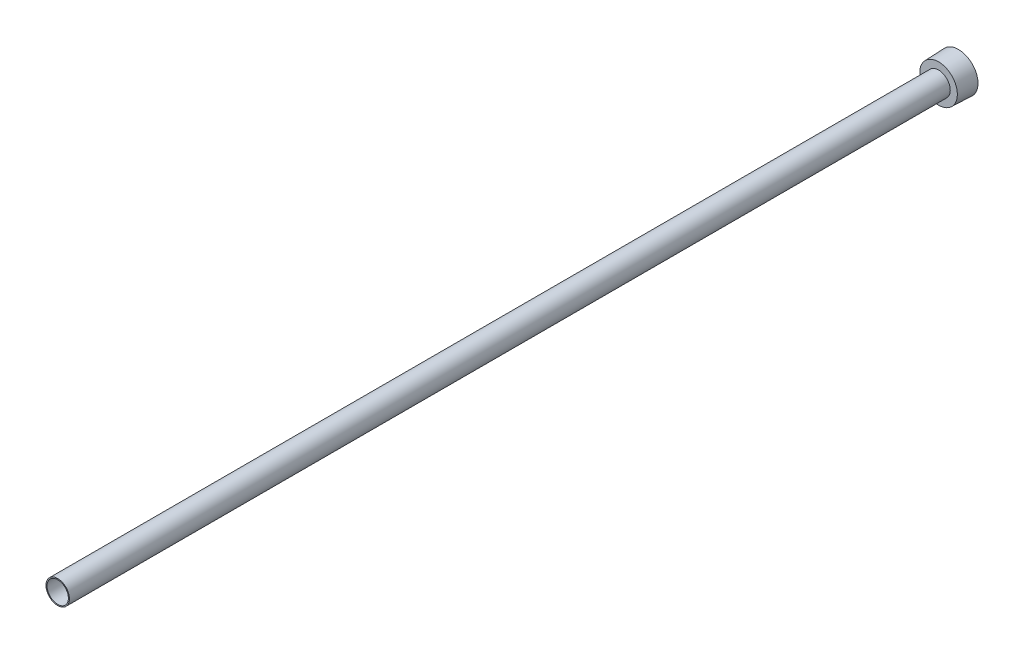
ISO-10303-21;
HEADER;
FILE_DESCRIPTION(('STEP AP214'),'2;1');
FILE_NAME('part.step','',(''),(''),'','','');
FILE_SCHEMA(('AUTOMOTIVE_DESIGN { 1 0 10303 214 1 1 1 1 }'));
ENDSEC;
DATA;
#1=APPLICATION_CONTEXT('core data for automotive mechanical design processes');
#2=APPLICATION_PROTOCOL_DEFINITION('international standard','automotive_design',2000,#1);
#3=PRODUCT_CONTEXT('',#1,'mechanical');
#4=PRODUCT('Part','Part','',(#3));
#5=PRODUCT_RELATED_PRODUCT_CATEGORY('part','',(#4));
#6=PRODUCT_DEFINITION_FORMATION('','',#4);
#7=PRODUCT_DEFINITION_CONTEXT('part definition',#1,'design');
#8=PRODUCT_DEFINITION('design','',#6,#7);
#9=PRODUCT_DEFINITION_SHAPE('','',#8);
#10=(LENGTH_UNIT() NAMED_UNIT(*) SI_UNIT(.MILLI.,.METRE.));
#11=(NAMED_UNIT(*) PLANE_ANGLE_UNIT() SI_UNIT($,.RADIAN.));
#12=(NAMED_UNIT(*) SI_UNIT($,.STERADIAN.) SOLID_ANGLE_UNIT());
#13=UNCERTAINTY_MEASURE_WITH_UNIT(LENGTH_MEASURE(1.E-05),#10,'distance_accuracy_value','');
#14=(GEOMETRIC_REPRESENTATION_CONTEXT(3) GLOBAL_UNCERTAINTY_ASSIGNED_CONTEXT((#13)) GLOBAL_UNIT_ASSIGNED_CONTEXT((#10,
#11,#12)) REPRESENTATION_CONTEXT('',''));
#15=CARTESIAN_POINT('',(0.,0.,0.));
#16=DIRECTION('',(0.,0.,1.));
#17=DIRECTION('',(1.,0.,0.));
#18=AXIS2_PLACEMENT_3D('',#15,#16,#17);
#19=CARTESIAN_POINT('',(0.,0.,0.));
#20=DIRECTION('',(0.,0.,1.));
#21=DIRECTION('',(1.,0.,0.));
#22=AXIS2_PLACEMENT_3D('',#19,#20,#21);
#23=CYLINDRICAL_SURFACE('',#22,7.2263);
#24=CARTESIAN_POINT('',(0.,0.,609.6));
#25=DIRECTION('',(0.,0.,1.));
#26=DIRECTION('',(1.,0.,0.));
#27=AXIS2_PLACEMENT_3D('',#24,#25,#26);
#28=CIRCLE('',#27,7.2263);
#29=CARTESIAN_POINT('',(7.2263,0.,609.6));
#30=VERTEX_POINT('',#29);
#31=EDGE_CURVE('E142',#30,#30,#28,.T.);
#32=CARTESIAN_POINT('',(0.,0.,9.525));
#33=DIRECTION('',(0.,0.,-1.));
#34=DIRECTION('',(-1.,0.,0.));
#35=AXIS2_PLACEMENT_3D('',#32,#33,#34);
#36=CIRCLE('',#35,7.2263);
#37=CARTESIAN_POINT('',(7.2263,0.,9.525));
#38=VERTEX_POINT('',#37);
#39=EDGE_CURVE('E37',#38,#38,#36,.F.);
#40=CARTESIAN_POINT('',(7.2263,0.,609.6));
#41=CARTESIAN_POINT('',(7.2263,0.,603.34921875));
#42=CARTESIAN_POINT('',(7.2263,0.,597.0984375));
#43=CARTESIAN_POINT('',(7.2263,0.,584.596875));
#44=CARTESIAN_POINT('',(7.2263,0.,578.34609375));
#45=CARTESIAN_POINT('',(7.2263,0.,565.84453125));
#46=CARTESIAN_POINT('',(7.2263,0.,559.59375));
#47=CARTESIAN_POINT('',(7.2263,0.,547.0921875));
#48=CARTESIAN_POINT('',(7.2263,0.,540.84140625));
#49=CARTESIAN_POINT('',(7.2263,0.,528.33984375));
#50=CARTESIAN_POINT('',(7.2263,0.,522.0890625));
#51=CARTESIAN_POINT('',(7.2263,0.,509.5875));
#52=CARTESIAN_POINT('',(7.2263,0.,503.33671875));
#53=CARTESIAN_POINT('',(7.2263,0.,490.83515625));
#54=CARTESIAN_POINT('',(7.2263,0.,484.584375));
#55=CARTESIAN_POINT('',(7.2263,0.,472.0828125));
#56=CARTESIAN_POINT('',(7.2263,0.,465.83203125));
#57=CARTESIAN_POINT('',(7.2263,0.,453.33046875));
#58=CARTESIAN_POINT('',(7.2263,0.,447.0796875));
#59=CARTESIAN_POINT('',(7.2263,0.,434.578125));
#60=CARTESIAN_POINT('',(7.2263,0.,428.32734375));
#61=CARTESIAN_POINT('',(7.2263,0.,415.82578125));
#62=CARTESIAN_POINT('',(7.2263,0.,409.575));
#63=CARTESIAN_POINT('',(7.2263,0.,397.0734375));
#64=CARTESIAN_POINT('',(7.2263,0.,390.82265625));
#65=CARTESIAN_POINT('',(7.2263,0.,378.32109375));
#66=CARTESIAN_POINT('',(7.2263,0.,372.0703125));
#67=CARTESIAN_POINT('',(7.2263,0.,359.56875));
#68=CARTESIAN_POINT('',(7.2263,0.,353.31796875));
#69=CARTESIAN_POINT('',(7.2263,0.,340.81640625));
#70=CARTESIAN_POINT('',(7.2263,0.,334.565625));
#71=CARTESIAN_POINT('',(7.2263,0.,322.0640625));
#72=CARTESIAN_POINT('',(7.2263,0.,315.81328125));
#73=CARTESIAN_POINT('',(7.2263,0.,303.31171875));
#74=CARTESIAN_POINT('',(7.2263,0.,297.0609375));
#75=CARTESIAN_POINT('',(7.2263,0.,284.559375));
#76=CARTESIAN_POINT('',(7.2263,0.,278.30859375));
#77=CARTESIAN_POINT('',(7.2263,0.,265.80703125));
#78=CARTESIAN_POINT('',(7.2263,0.,259.55625));
#79=CARTESIAN_POINT('',(7.2263,0.,247.0546875));
#80=CARTESIAN_POINT('',(7.2263,0.,240.80390625));
#81=CARTESIAN_POINT('',(7.2263,0.,228.30234375));
#82=CARTESIAN_POINT('',(7.2263,0.,222.0515625));
#83=CARTESIAN_POINT('',(7.2263,0.,209.55));
#84=CARTESIAN_POINT('',(7.2263,0.,203.29921875));
#85=CARTESIAN_POINT('',(7.2263,0.,190.79765625));
#86=CARTESIAN_POINT('',(7.2263,0.,184.546875));
#87=CARTESIAN_POINT('',(7.2263,0.,172.0453125));
#88=CARTESIAN_POINT('',(7.2263,0.,165.79453125));
#89=CARTESIAN_POINT('',(7.2263,0.,153.29296875));
#90=CARTESIAN_POINT('',(7.2263,0.,147.0421875));
#91=CARTESIAN_POINT('',(7.2263,0.,134.540625));
#92=CARTESIAN_POINT('',(7.2263,0.,128.28984375));
#93=CARTESIAN_POINT('',(7.2263,0.,115.78828125));
#94=CARTESIAN_POINT('',(7.2263,0.,109.5375));
#95=CARTESIAN_POINT('',(7.2263,0.,97.0359375));
#96=CARTESIAN_POINT('',(7.2263,0.,90.78515625));
#97=CARTESIAN_POINT('',(7.2263,0.,78.28359375));
#98=CARTESIAN_POINT('',(7.2263,0.,72.0328125));
#99=CARTESIAN_POINT('',(7.2263,0.,59.53125));
#100=CARTESIAN_POINT('',(7.2263,0.,53.28046875));
#101=CARTESIAN_POINT('',(7.2263,0.,40.77890625));
#102=CARTESIAN_POINT('',(7.2263,0.,34.528125));
#103=CARTESIAN_POINT('',(7.2263,0.,22.0265625));
#104=CARTESIAN_POINT('',(7.2263,0.,15.77578125));
#105=CARTESIAN_POINT('',(7.2263,0.,9.525));
#106=B_SPLINE_CURVE_WITH_KNOTS('',3,(#40,#41,#42,#43,#44,#45,#46,#47,#48,#49,#50,#51,#52,#53,
#54,#55,#56,#57,#58,#59,#60,#61,#62,#63,#64,#65,#66,#67,#68,#69,#70,#71,#72,#73,#74,#75,#76,#77,
#78,#79,#80,#81,#82,#83,#84,#85,#86,#87,#88,#89,#90,#91,#92,#93,#94,#95,#96,#97,#98,#99,#100,
#101,#102,#103,#104,#105),.UNSPECIFIED.,.F.,.F.,(4,2,2,2,2,2,2,2,2,2,2,2,2,2,2,2,2,2,2,2,2,2,2,
2,2,2,2,2,2,2,2,2,4),(0.,18.75234375,37.5046875,56.25703125,75.009375,93.7617187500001,
112.5140625,131.26640625,150.01875,168.77109375,187.5234375,206.27578125,225.028125,
243.78046875,262.5328125,281.28515625,300.0375,318.78984375,337.5421875,356.29453125,375.046875,
393.79921875,412.5515625,431.30390625,450.05625,468.80859375,487.5609375,506.31328125,
525.065625,543.81796875,562.5703125,581.32265625,600.075),.UNSPECIFIED.);
#107=EDGE_CURVE('BSEAM33',#30,#38,#106,.T.);
#108=ORIENTED_EDGE('',*,*,#31,.T.);
#109=ORIENTED_EDGE('',*,*,#39,.F.);
#110=ORIENTED_EDGE('',*,*,#107,.T.);
#111=ORIENTED_EDGE('',*,*,#107,.F.);
#112=EDGE_LOOP('',(#108,#110,#109,#111));
#113=FACE_BOUND('',#112,.T.);
#114=ADVANCED_FACE('F33',(#113),#23,.F.);
#115=CARTESIAN_POINT('',(0.,7.93749999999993,609.6));
#116=DIRECTION('',(0.,0.,-1.));
#117=DIRECTION('',(-1.,0.,0.));
#118=AXIS2_PLACEMENT_3D('',#115,#116,#117);
#119=PLANE('',#118);
#120=ORIENTED_EDGE('',*,*,#31,.F.);
#121=EDGE_LOOP('',(#120));
#122=FACE_BOUND('',#121,.T.);
#123=CARTESIAN_POINT('',(0.,0.,609.6));
#124=DIRECTION('',(0.,0.,1.));
#125=DIRECTION('',(1.,0.,0.));
#126=AXIS2_PLACEMENT_3D('',#123,#124,#125);
#127=CIRCLE('',#126,7.93749999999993);
#128=CARTESIAN_POINT('',(7.93749999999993,0.,609.6));
#129=VERTEX_POINT('',#128);
#130=EDGE_CURVE('E145',#129,#129,#127,.T.);
#131=ORIENTED_EDGE('',*,*,#130,.T.);
#132=EDGE_LOOP('',(#131));
#133=FACE_BOUND('',#132,.T.);
#134=ADVANCED_FACE('F35',(#122,#133),#119,.F.);
#135=CARTESIAN_POINT('',(0.,0.,0.));
#136=DIRECTION('',(0.,0.,1.));
#137=DIRECTION('',(1.,0.,0.));
#138=AXIS2_PLACEMENT_3D('',#135,#136,#137);
#139=PLANE('',#138);
#140=DIRECTION('',(-0.866025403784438,0.5,0.));
#141=VECTOR('',#140,1.);
#142=CARTESIAN_POINT('',(0.,-10.9985226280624,0.));
#143=LINE('',#142,#141);
#144=CARTESIAN_POINT('',(0.,-10.9985226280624,0.));
#145=VERTEX_POINT('',#144);
#146=CARTESIAN_POINT('',(-9.525,-5.49926131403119,0.));
#147=VERTEX_POINT('',#146);
#148=EDGE_CURVE('E124',#145,#147,#143,.T.);
#149=ORIENTED_EDGE('',*,*,#148,.F.);
#150=DIRECTION('',(-0.866025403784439,-0.5,0.));
#151=VECTOR('',#150,1.);
#152=CARTESIAN_POINT('',(9.525,-5.49926131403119,0.));
#153=LINE('',#152,#151);
#154=CARTESIAN_POINT('',(9.525,-5.49926131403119,0.));
#155=VERTEX_POINT('',#154);
#156=EDGE_CURVE('E49',#155,#145,#153,.T.);
#157=ORIENTED_EDGE('',*,*,#156,.F.);
#158=DIRECTION('',(0.,-1.,0.));
#159=VECTOR('',#158,1.);
#160=CARTESIAN_POINT('',(9.525,5.49926131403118,0.));
#161=LINE('',#160,#159);
#162=CARTESIAN_POINT('',(9.525,5.49926131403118,0.));
#163=VERTEX_POINT('',#162);
#164=EDGE_CURVE('E133',#163,#155,#161,.T.);
#165=ORIENTED_EDGE('',*,*,#164,.F.);
#166=DIRECTION('',(0.866025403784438,-0.5,0.));
#167=VECTOR('',#166,1.);
#168=CARTESIAN_POINT('',(0.,10.9985226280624,0.));
#169=LINE('',#168,#167);
#170=CARTESIAN_POINT('',(0.,10.9985226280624,0.));
#171=VERTEX_POINT('',#170);
#172=EDGE_CURVE('E131',#171,#163,#169,.T.);
#173=ORIENTED_EDGE('',*,*,#172,.F.);
#174=DIRECTION('',(0.866025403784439,0.5,0.));
#175=VECTOR('',#174,1.);
#176=CARTESIAN_POINT('',(-9.525,5.49926131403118,0.));
#177=LINE('',#176,#175);
#178=CARTESIAN_POINT('',(-9.525,5.49926131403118,0.));
#179=VERTEX_POINT('',#178);
#180=EDGE_CURVE('E97',#179,#171,#177,.T.);
#181=ORIENTED_EDGE('',*,*,#180,.F.);
#182=DIRECTION('',(0.,1.,0.));
#183=VECTOR('',#182,1.);
#184=CARTESIAN_POINT('',(-9.525,-5.49926131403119,0.));
#185=LINE('',#184,#183);
#186=EDGE_CURVE('E127',#147,#179,#185,.T.);
#187=ORIENTED_EDGE('',*,*,#186,.F.);
#188=EDGE_LOOP('',(#149,#157,#165,#173,#181,#187));
#189=FACE_BOUND('',#188,.T.);
#190=CARTESIAN_POINT('',(0.,0.,0.));
#191=DIRECTION('',(0.,0.,1.));
#192=DIRECTION('',(1.,0.,0.));
#193=AXIS2_PLACEMENT_3D('',#190,#191,#192);
#194=CIRCLE('',#193,13.2207);
#195=CARTESIAN_POINT('',(13.2207,0.,0.));
#196=VERTEX_POINT('',#195);
#197=EDGE_CURVE('E11',#196,#196,#194,.T.);
#198=ORIENTED_EDGE('',*,*,#197,.F.);
#199=EDGE_LOOP('',(#198));
#200=FACE_BOUND('',#199,.T.);
#201=ADVANCED_FACE('F159',(#189,#200),#139,.F.);
#202=CARTESIAN_POINT('',(0.,0.,0.));
#203=DIRECTION('',(0.,0.,-1.));
#204=DIRECTION('',(-1.,0.,0.));
#205=AXIS2_PLACEMENT_3D('',#202,#203,#204);
#206=CONICAL_SURFACE('',#205,13.2207,0.0364599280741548);
#207=CARTESIAN_POINT('',(0.,0.,13.4874));
#208=DIRECTION('',(0.,0.,1.));
#209=DIRECTION('',(1.,0.,0.));
#210=AXIS2_PLACEMENT_3D('',#207,#208,#209);
#211=CIRCLE('',#210,12.7287323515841);
#212=CARTESIAN_POINT('',(12.7287323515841,0.,13.4874));
#213=VERTEX_POINT('',#212);
#214=EDGE_CURVE('E42',#213,#213,#211,.T.);
#215=ORIENTED_EDGE('',*,*,#214,.F.);
#216=EDGE_LOOP('',(#215));
#217=FACE_BOUND('',#216,.T.);
#218=ORIENTED_EDGE('',*,*,#197,.T.);
#219=EDGE_LOOP('',(#218));
#220=FACE_BOUND('',#219,.T.);
#221=ADVANCED_FACE('F156',(#217,#220),#206,.T.);
#222=CARTESIAN_POINT('',(0.,12.7287323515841,13.4874));
#223=DIRECTION('',(0.,0.,-1.));
#224=DIRECTION('',(-1.,0.,0.));
#225=AXIS2_PLACEMENT_3D('',#222,#223,#224);
#226=PLANE('',#225);
#227=CARTESIAN_POINT('',(0.,0.,13.4874));
#228=DIRECTION('',(0.,0.,1.));
#229=DIRECTION('',(1.,0.,0.));
#230=AXIS2_PLACEMENT_3D('',#227,#228,#229);
#231=CIRCLE('',#230,7.9375);
#232=CARTESIAN_POINT('',(7.9375,0.,13.4874));
#233=VERTEX_POINT('',#232);
#234=EDGE_CURVE('E148',#233,#233,#231,.T.);
#235=ORIENTED_EDGE('',*,*,#234,.F.);
#236=EDGE_LOOP('',(#235));
#237=FACE_BOUND('',#236,.T.);
#238=ORIENTED_EDGE('',*,*,#214,.T.);
#239=EDGE_LOOP('',(#238));
#240=FACE_BOUND('',#239,.T.);
#241=ADVANCED_FACE('F154',(#237,#240),#226,.F.);
#242=CARTESIAN_POINT('',(0.,0.,278.00111462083));
#243=DIRECTION('',(0.,0.,1.));
#244=DIRECTION('',(1.,0.,0.));
#245=AXIS2_PLACEMENT_3D('',#242,#243,#244);
#246=CYLINDRICAL_SURFACE('',#245,7.93749999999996);
#247=ORIENTED_EDGE('',*,*,#130,.F.);
#248=EDGE_LOOP('',(#247));
#249=FACE_BOUND('',#248,.T.);
#250=ORIENTED_EDGE('',*,*,#234,.T.);
#251=EDGE_LOOP('',(#250));
#252=FACE_BOUND('',#251,.T.);
#253=ADVANCED_FACE('F180',(#249,#252),#246,.T.);
#254=CARTESIAN_POINT('',(0.,-10.9985226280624,9.525));
#255=DIRECTION('',(0.,0.,-1.));
#256=DIRECTION('',(-1.,0.,0.));
#257=AXIS2_PLACEMENT_3D('',#254,#255,#256);
#258=PLANE('',#257);
#259=DIRECTION('',(-0.866025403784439,-0.5,0.));
#260=VECTOR('',#259,1.);
#261=CARTESIAN_POINT('',(9.525,-5.49926131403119,9.525));
#262=LINE('',#261,#260);
#263=CARTESIAN_POINT('',(9.525,-5.49926131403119,9.525));
#264=VERTEX_POINT('',#263);
#265=CARTESIAN_POINT('',(0.,-10.9985226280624,9.525));
#266=VERTEX_POINT('',#265);
#267=EDGE_CURVE('E135',#264,#266,#262,.T.);
#268=ORIENTED_EDGE('',*,*,#267,.T.);
#269=DIRECTION('',(-0.866025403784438,0.5,0.));
#270=VECTOR('',#269,1.);
#271=CARTESIAN_POINT('',(0.,-10.9985226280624,9.525));
#272=LINE('',#271,#270);
#273=CARTESIAN_POINT('',(-9.525,-5.49926131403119,9.525));
#274=VERTEX_POINT('',#273);
#275=EDGE_CURVE('E118',#266,#274,#272,.T.);
#276=ORIENTED_EDGE('',*,*,#275,.T.);
#277=DIRECTION('',(0.,1.,0.));
#278=VECTOR('',#277,1.);
#279=CARTESIAN_POINT('',(-9.525,-5.49926131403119,9.525));
#280=LINE('',#279,#278);
#281=CARTESIAN_POINT('',(-9.525,5.49926131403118,9.525));
#282=VERTEX_POINT('',#281);
#283=EDGE_CURVE('E116',#274,#282,#280,.T.);
#284=ORIENTED_EDGE('',*,*,#283,.T.);
#285=DIRECTION('',(0.866025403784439,0.5,0.));
#286=VECTOR('',#285,1.);
#287=CARTESIAN_POINT('',(-9.525,5.49926131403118,9.525));
#288=LINE('',#287,#286);
#289=CARTESIAN_POINT('',(0.,10.9985226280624,9.525));
#290=VERTEX_POINT('',#289);
#291=EDGE_CURVE('E94',#282,#290,#288,.T.);
#292=ORIENTED_EDGE('',*,*,#291,.T.);
#293=DIRECTION('',(0.866025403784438,-0.5,0.));
#294=VECTOR('',#293,1.);
#295=CARTESIAN_POINT('',(0.,10.9985226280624,9.525));
#296=LINE('',#295,#294);
#297=CARTESIAN_POINT('',(9.525,5.49926131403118,9.525));
#298=VERTEX_POINT('',#297);
#299=EDGE_CURVE('E105',#290,#298,#296,.T.);
#300=ORIENTED_EDGE('',*,*,#299,.T.);
#301=DIRECTION('',(0.,-1.,0.));
#302=VECTOR('',#301,1.);
#303=CARTESIAN_POINT('',(9.525,5.49926131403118,9.525));
#304=LINE('',#303,#302);
#305=EDGE_CURVE('E109',#298,#264,#304,.T.);
#306=ORIENTED_EDGE('',*,*,#305,.T.);
#307=EDGE_LOOP('',(#268,#276,#284,#292,#300,#306));
#308=FACE_BOUND('',#307,.T.);
#309=ORIENTED_EDGE('',*,*,#39,.T.);
#310=EDGE_LOOP('',(#309));
#311=FACE_BOUND('',#310,.T.);
#312=ADVANCED_FACE('F112',(#308,#311),#258,.T.);
#313=CARTESIAN_POINT('',(9.525,-5.49926131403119,9.525));
#314=DIRECTION('',(0.5,-0.866025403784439,0.));
#315=DIRECTION('',(0.866025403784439,0.5,0.));
#316=AXIS2_PLACEMENT_3D('',#313,#314,#315);
#317=PLANE('',#316);
#318=ORIENTED_EDGE('',*,*,#156,.T.);
#319=DIRECTION('',(0.,0.,-1.));
#320=VECTOR('',#319,1.);
#321=CARTESIAN_POINT('',(0.,-10.9985226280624,9.525));
#322=LINE('',#321,#320);
#323=EDGE_CURVE('E79',#266,#145,#322,.T.);
#324=ORIENTED_EDGE('',*,*,#323,.F.);
#325=ORIENTED_EDGE('',*,*,#267,.F.);
#326=DIRECTION('',(0.,0.,-1.));
#327=VECTOR('',#326,1.);
#328=CARTESIAN_POINT('',(9.525,-5.49926131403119,9.525));
#329=LINE('',#328,#327);
#330=EDGE_CURVE('E57',#264,#155,#329,.T.);
#331=ORIENTED_EDGE('',*,*,#330,.T.);
#332=EDGE_LOOP('',(#318,#324,#325,#331));
#333=FACE_BOUND('',#332,.T.);
#334=ADVANCED_FACE('F178',(#333),#317,.F.);
#335=CARTESIAN_POINT('',(9.525,5.49926131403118,9.525));
#336=DIRECTION('',(1.,0.,0.));
#337=DIRECTION('',(0.,0.,-1.));
#338=AXIS2_PLACEMENT_3D('',#335,#336,#337);
#339=PLANE('',#338);
#340=ORIENTED_EDGE('',*,*,#164,.T.);
#341=ORIENTED_EDGE('',*,*,#330,.F.);
#342=ORIENTED_EDGE('',*,*,#305,.F.);
#343=DIRECTION('',(0.,0.,-1.));
#344=VECTOR('',#343,1.);
#345=CARTESIAN_POINT('',(9.525,5.49926131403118,9.525));
#346=LINE('',#345,#344);
#347=EDGE_CURVE('E101',#298,#163,#346,.T.);
#348=ORIENTED_EDGE('',*,*,#347,.T.);
#349=EDGE_LOOP('',(#340,#341,#342,#348));
#350=FACE_BOUND('',#349,.T.);
#351=ADVANCED_FACE('F209',(#350),#339,.F.);
#352=CARTESIAN_POINT('',(0.,10.9985226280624,9.525));
#353=DIRECTION('',(0.5,0.866025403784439,0.));
#354=DIRECTION('',(-0.866025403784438,0.5,0.));
#355=AXIS2_PLACEMENT_3D('',#352,#353,#354);
#356=PLANE('',#355);
#357=ORIENTED_EDGE('',*,*,#172,.T.);
#358=ORIENTED_EDGE('',*,*,#347,.F.);
#359=ORIENTED_EDGE('',*,*,#299,.F.);
#360=DIRECTION('',(0.,0.,-1.));
#361=VECTOR('',#360,1.);
#362=CARTESIAN_POINT('',(0.,10.9985226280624,9.525));
#363=LINE('',#362,#361);
#364=EDGE_CURVE('E90',#290,#171,#363,.T.);
#365=ORIENTED_EDGE('',*,*,#364,.T.);
#366=EDGE_LOOP('',(#357,#358,#359,#365));
#367=FACE_BOUND('',#366,.T.);
#368=ADVANCED_FACE('F106',(#367),#356,.F.);
#369=CARTESIAN_POINT('',(-9.525,5.49926131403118,9.525));
#370=DIRECTION('',(-0.5,0.866025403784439,0.));
#371=DIRECTION('',(-0.866025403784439,-0.5,0.));
#372=AXIS2_PLACEMENT_3D('',#369,#370,#371);
#373=PLANE('',#372);
#374=ORIENTED_EDGE('',*,*,#180,.T.);
#375=ORIENTED_EDGE('',*,*,#364,.F.);
#376=ORIENTED_EDGE('',*,*,#291,.F.);
#377=DIRECTION('',(0.,0.,-1.));
#378=VECTOR('',#377,1.);
#379=CARTESIAN_POINT('',(-9.525,5.49926131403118,9.525));
#380=LINE('',#379,#378);
#381=EDGE_CURVE('E102',#282,#179,#380,.T.);
#382=ORIENTED_EDGE('',*,*,#381,.T.);
#383=EDGE_LOOP('',(#374,#375,#376,#382));
#384=FACE_BOUND('',#383,.T.);
#385=ADVANCED_FACE('F92',(#384),#373,.F.);
#386=CARTESIAN_POINT('',(-9.525,-5.49926131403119,9.525));
#387=DIRECTION('',(-1.,0.,0.));
#388=DIRECTION('',(0.,0.,1.));
#389=AXIS2_PLACEMENT_3D('',#386,#387,#388);
#390=PLANE('',#389);
#391=ORIENTED_EDGE('',*,*,#186,.T.);
#392=ORIENTED_EDGE('',*,*,#381,.F.);
#393=ORIENTED_EDGE('',*,*,#283,.F.);
#394=DIRECTION('',(0.,0.,-1.));
#395=VECTOR('',#394,1.);
#396=CARTESIAN_POINT('',(-9.525,-5.49926131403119,9.525));
#397=LINE('',#396,#395);
#398=EDGE_CURVE('E139',#274,#147,#397,.T.);
#399=ORIENTED_EDGE('',*,*,#398,.T.);
#400=EDGE_LOOP('',(#391,#392,#393,#399));
#401=FACE_BOUND('',#400,.T.);
#402=ADVANCED_FACE('F227',(#401),#390,.F.);
#403=CARTESIAN_POINT('',(0.,-10.9985226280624,9.525));
#404=DIRECTION('',(-0.5,-0.866025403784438,0.));
#405=DIRECTION('',(0.866025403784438,-0.5,0.));
#406=AXIS2_PLACEMENT_3D('',#403,#404,#405);
#407=PLANE('',#406);
#408=ORIENTED_EDGE('',*,*,#148,.T.);
#409=ORIENTED_EDGE('',*,*,#398,.F.);
#410=ORIENTED_EDGE('',*,*,#275,.F.);
#411=ORIENTED_EDGE('',*,*,#323,.T.);
#412=EDGE_LOOP('',(#408,#409,#410,#411));
#413=FACE_BOUND('',#412,.T.);
#414=ADVANCED_FACE('F234',(#413),#407,.F.);
#415=CLOSED_SHELL('',(#114,#134,#201,#221,#241,#253,#312,#334,#351,#368,#385,#402,#414));
#416=MANIFOLD_SOLID_BREP('B2',#415);
#417=ADVANCED_BREP_SHAPE_REPRESENTATION('',(#18,#416),#14);
#418=SHAPE_DEFINITION_REPRESENTATION(#9,#417);
ENDSEC;
END-ISO-10303-21;
